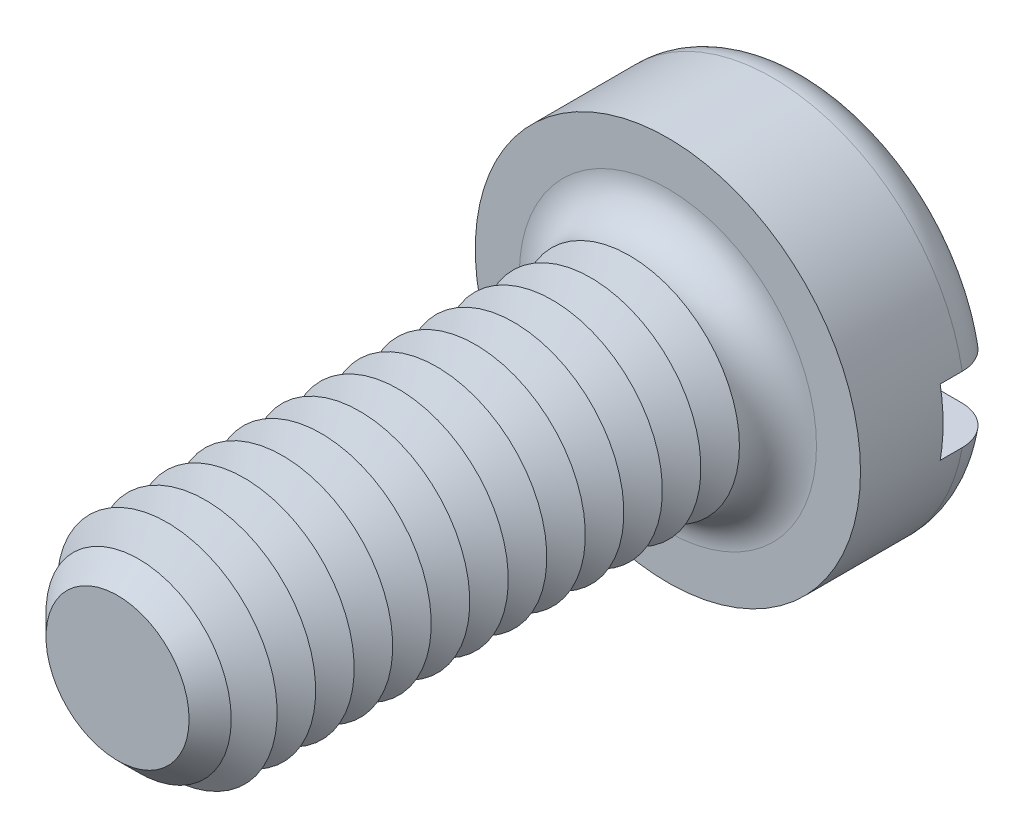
ISO-10303-21;
HEADER;
FILE_DESCRIPTION(('STEP AP214'),'2;1');
FILE_NAME('part.step','',(''),(''),'','','');
FILE_SCHEMA(('AUTOMOTIVE_DESIGN { 1 0 10303 214 1 1 1 1 }'));
ENDSEC;
DATA;
#1=APPLICATION_CONTEXT('core data for automotive mechanical design processes');
#2=APPLICATION_PROTOCOL_DEFINITION('international standard','automotive_design',2000,#1);
#3=PRODUCT_CONTEXT('',#1,'mechanical');
#4=PRODUCT('Part','Part','',(#3));
#5=PRODUCT_RELATED_PRODUCT_CATEGORY('part','',(#4));
#6=PRODUCT_DEFINITION_FORMATION('','',#4);
#7=PRODUCT_DEFINITION_CONTEXT('part definition',#1,'design');
#8=PRODUCT_DEFINITION('design','',#6,#7);
#9=PRODUCT_DEFINITION_SHAPE('','',#8);
#10=(LENGTH_UNIT() NAMED_UNIT(*) SI_UNIT(.MILLI.,.METRE.));
#11=(NAMED_UNIT(*) PLANE_ANGLE_UNIT() SI_UNIT($,.RADIAN.));
#12=(NAMED_UNIT(*) SI_UNIT($,.STERADIAN.) SOLID_ANGLE_UNIT());
#13=UNCERTAINTY_MEASURE_WITH_UNIT(LENGTH_MEASURE(1.E-05),#10,'distance_accuracy_value','');
#14=(GEOMETRIC_REPRESENTATION_CONTEXT(3) GLOBAL_UNCERTAINTY_ASSIGNED_CONTEXT((#13)) GLOBAL_UNIT_ASSIGNED_CONTEXT((#10,
#11,#12)) REPRESENTATION_CONTEXT('',''));
#15=CARTESIAN_POINT('',(0.,0.,0.));
#16=DIRECTION('',(0.,0.,1.));
#17=DIRECTION('',(1.,0.,0.));
#18=AXIS2_PLACEMENT_3D('',#15,#16,#17);
#19=CARTESIAN_POINT('',(0.,0.,-2.6));
#20=DIRECTION('',(0.,0.,1.));
#21=DIRECTION('',(1.,0.,0.));
#22=AXIS2_PLACEMENT_3D('',#19,#20,#21);
#23=PLANE('',#22);
#24=CARTESIAN_POINT('',(0.,0.,-2.6));
#25=DIRECTION('',(0.,0.,1.));
#26=DIRECTION('',(1.,0.,0.));
#27=AXIS2_PLACEMENT_3D('',#24,#25,#26);
#28=CIRCLE('',#27,2.8);
#29=CARTESIAN_POINT('',(-2.73495886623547,0.6,-2.6));
#30=VERTEX_POINT('',#29);
#31=CARTESIAN_POINT('',(2.73495886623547,0.6,-2.6));
#32=VERTEX_POINT('',#31);
#33=EDGE_CURVE('E116',#30,#32,#28,.F.);
#34=ORIENTED_EDGE('',*,*,#33,.T.);
#35=DIRECTION('',(1.,0.,0.));
#36=VECTOR('',#35,1.);
#37=CARTESIAN_POINT('',(-3.5,0.600000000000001,-2.6));
#38=LINE('',#37,#36);
#39=EDGE_CURVE('E111',#30,#32,#38,.T.);
#40=ORIENTED_EDGE('',*,*,#39,.F.);
#41=EDGE_LOOP('',(#34,#40));
#42=FACE_BOUND('',#41,.T.);
#43=ADVANCED_FACE('F39',(#42),#23,.F.);
#44=CARTESIAN_POINT('',(0.,0.,-1.9));
#45=DIRECTION('',(0.,0.,1.));
#46=DIRECTION('',(1.,0.,0.));
#47=AXIS2_PLACEMENT_3D('',#44,#45,#46);
#48=TOROIDAL_SURFACE('',#47,2.8,0.7);
#49=CARTESIAN_POINT('',(-3.24550494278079,0.600000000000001,-2.38938679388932));
#50=CARTESIAN_POINT('',(-3.21724139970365,0.600000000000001,-2.41780774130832));
#51=CARTESIAN_POINT('',(-3.18652103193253,0.600000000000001,-2.44383169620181));
#52=CARTESIAN_POINT('',(-3.12110229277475,0.600000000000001,-2.49034599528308));
#53=CARTESIAN_POINT('',(-3.08639834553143,0.6,-2.51082844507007));
#54=CARTESIAN_POINT('',(-3.01410013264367,0.6,-2.54568075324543));
#55=CARTESIAN_POINT('',(-2.97650963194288,0.6,-2.56005841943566));
#56=CARTESIAN_POINT('',(-2.89948250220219,0.6,-2.58239238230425));
#57=CARTESIAN_POINT('',(-2.86004633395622,0.6,-2.59035027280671));
#58=CARTESIAN_POINT('',(-2.77983715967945,0.6,-2.5997577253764));
#59=CARTESIAN_POINT('',(-2.73905311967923,0.6,-2.60111317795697));
#60=CARTESIAN_POINT('',(-2.65781876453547,0.6,-2.59706866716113));
#61=CARTESIAN_POINT('',(-2.61736849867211,0.6,-2.59166772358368));
#62=CARTESIAN_POINT('',(-2.53729983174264,0.6,-2.57414594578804));
#63=CARTESIAN_POINT('',(-2.49770360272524,0.6,-2.56192363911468));
#64=CARTESIAN_POINT('',(-2.421111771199,0.6,-2.5310238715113));
#65=CARTESIAN_POINT('',(-2.38411632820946,0.6,-2.51234601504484));
#66=CARTESIAN_POINT('',(-2.31371213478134,0.6,-2.46896762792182));
#67=CARTESIAN_POINT('',(-2.28031240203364,0.6,-2.44425244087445));
#68=CARTESIAN_POINT('',(-2.21823311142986,0.6,-2.38946667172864));
#69=CARTESIAN_POINT('',(-2.18955321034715,0.6,-2.35939647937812));
#70=CARTESIAN_POINT('',(-2.13836074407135,0.6,-2.29532787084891));
#71=CARTESIAN_POINT('',(-2.11574147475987,0.6,-2.26141482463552));
#72=CARTESIAN_POINT('',(-2.07677080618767,0.6,-2.19015935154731));
#73=CARTESIAN_POINT('',(-2.06041784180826,0.6,-2.15281778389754));
#74=CARTESIAN_POINT('',(-2.03508596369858,0.6,-2.07723332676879));
#75=CARTESIAN_POINT('',(-2.02585871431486,0.6,-2.03907365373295));
#76=CARTESIAN_POINT('',(-2.01416722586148,0.6,-1.96173417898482));
#77=CARTESIAN_POINT('',(-2.01170151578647,0.6,-1.92255460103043));
#78=CARTESIAN_POINT('',(-2.01359934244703,0.6,-1.84555709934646));
#79=CARTESIAN_POINT('',(-2.01775787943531,0.6,-1.80773393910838));
#80=CARTESIAN_POINT('',(-2.03236373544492,0.6,-1.73332511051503));
#81=CARTESIAN_POINT('',(-2.04281097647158,0.6,-1.69673942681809));
#82=CARTESIAN_POINT('',(-2.06962963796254,0.6,-1.62577336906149));
#83=CARTESIAN_POINT('',(-2.08600685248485,0.6,-1.59139519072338));
#84=CARTESIAN_POINT('',(-2.12413495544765,0.6,-1.52576356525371));
#85=CARTESIAN_POINT('',(-2.14588657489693,0.6,-1.49451054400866));
#86=CARTESIAN_POINT('',(-2.19483541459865,0.6,-1.43498643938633));
#87=CARTESIAN_POINT('',(-2.22217844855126,0.6,-1.40683532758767));
#88=CARTESIAN_POINT('',(-2.28105616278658,0.6,-1.35532544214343));
#89=CARTESIAN_POINT('',(-2.3125916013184,0.6,-1.33196753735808));
#90=CARTESIAN_POINT('',(-2.38018779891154,0.6,-1.28984356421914));
#91=CARTESIAN_POINT('',(-2.41637068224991,0.6,-1.27127330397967));
#92=CARTESIAN_POINT('',(-2.49129688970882,0.6,-1.24032971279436));
#93=CARTESIAN_POINT('',(-2.53004053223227,0.6,-1.22795715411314));
#94=CARTESIAN_POINT('',(-2.6098393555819,0.6,-1.2095515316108));
#95=CARTESIAN_POINT('',(-2.65092550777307,0.6,-1.20365237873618));
#96=CARTESIAN_POINT('',(-2.7335069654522,0.6,-1.1988380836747));
#97=CARTESIAN_POINT('',(-2.7750022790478,0.6,-1.19992308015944));
#98=CARTESIAN_POINT('',(-2.85718851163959,0.6,-1.20909046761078));
#99=CARTESIAN_POINT('',(-2.8978799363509,0.6,-1.21716830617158));
#100=CARTESIAN_POINT('',(-2.97729176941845,0.6,-1.24014327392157));
#101=CARTESIAN_POINT('',(-3.01601231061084,0.6,-1.25503994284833));
#102=CARTESIAN_POINT('',(-3.08976822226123,0.6,-1.29101066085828));
#103=CARTESIAN_POINT('',(-3.12484927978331,0.600000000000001,-1.31199098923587));
#104=CARTESIAN_POINT('',(-3.19090022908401,0.600000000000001,-1.35965144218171));
#105=CARTESIAN_POINT('',(-3.22187053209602,0.600000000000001,-1.38633099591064));
#106=CARTESIAN_POINT('',(-3.2781946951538,0.600000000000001,-1.44408564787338));
#107=CARTESIAN_POINT('',(-3.3036441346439,0.600000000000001,-1.47506754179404));
#108=CARTESIAN_POINT('',(-3.34887649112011,0.600000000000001,-1.54092398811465));
#109=CARTESIAN_POINT('',(-3.36865993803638,0.600000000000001,-1.57579817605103));
#110=CARTESIAN_POINT('',(-3.40166738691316,0.600000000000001,-1.64783067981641));
#111=CARTESIAN_POINT('',(-3.41499360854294,0.600000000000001,-1.68494217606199));
#112=CARTESIAN_POINT('',(-3.43515375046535,0.600000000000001,-1.76088675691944));
#113=CARTESIAN_POINT('',(-3.44198836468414,0.600000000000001,-1.79971965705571));
#114=CARTESIAN_POINT('',(-3.44891916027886,0.600000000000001,-1.87757893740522));
#115=CARTESIAN_POINT('',(-3.44908375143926,0.600000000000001,-1.91659924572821));
#116=CARTESIAN_POINT('',(-3.44284111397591,0.600000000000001,-1.99412088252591));
#117=CARTESIAN_POINT('',(-3.43643236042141,0.600000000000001,-2.03262208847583));
#118=CARTESIAN_POINT('',(-3.41725803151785,0.600000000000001,-2.10792315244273));
#119=CARTESIAN_POINT('',(-3.40450469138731,0.600000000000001,-2.14472613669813));
#120=CARTESIAN_POINT('',(-3.3730385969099,0.600000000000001,-2.21565060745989));
#121=CARTESIAN_POINT('',(-3.35433321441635,0.600000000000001,-2.24977534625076));
#122=CARTESIAN_POINT('',(-3.3201892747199,0.600000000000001,-2.30136364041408));
#123=CARTESIAN_POINT('',(-3.30647805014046,0.600000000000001,-2.31999402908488));
#124=CARTESIAN_POINT('',(-3.27728518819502,0.600000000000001,-2.35581090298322));
#125=CARTESIAN_POINT('',(-3.26180356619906,0.600000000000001,-2.37299740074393));
#126=CARTESIAN_POINT('',(-3.24550494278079,0.600000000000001,-2.38938679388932));
#127=B_SPLINE_CURVE_WITH_KNOTS('',3,(#49,#50,#51,#52,#53,#54,#55,#56,#57,#58,#59,#60,#61,#62,
#63,#64,#65,#66,#67,#68,#69,#70,#71,#72,#73,#74,#75,#76,#77,#78,#79,#80,#81,#82,#83,#84,#85,#86,
#87,#88,#89,#90,#91,#92,#93,#94,#95,#96,#97,#98,#99,#100,#101,#102,#103,#104,#105,#106,#107,
#108,#109,#110,#111,#112,#113,#114,#115,#116,#117,#118,#119,#120,#121,#122,#123,#124,#125,#126),
.UNSPECIFIED.,.T.,.F.,(4,2,2,2,2,2,2,2,2,2,2,2,2,2,2,2,2,2,2,2,2,2,2,2,2,2,2,2,2,2,2,2,2,2,2,2,
2,2,4),(0.,0.120160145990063,0.240490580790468,0.36066665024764,0.480812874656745,
0.602666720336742,0.724538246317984,0.848272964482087,0.972015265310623,1.09606100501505,
1.2200977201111,1.34178071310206,1.46343329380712,1.58062647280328,1.6977941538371,
1.81140573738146,1.92501591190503,2.03873739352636,2.15247435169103,2.26967910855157,
2.38690509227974,2.50835551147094,2.62982106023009,2.75375450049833,2.87769040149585,
3.00154567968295,3.12539259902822,3.24742469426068,3.36944457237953,3.48914477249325,
3.60883377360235,3.72656056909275,3.84427477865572,3.96078136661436,4.07731498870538,
4.19362474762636,4.3097910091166,4.37908387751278,4.44837614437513),.UNSPECIFIED.);
#128=CARTESIAN_POINT('',(-3.44818792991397,0.600000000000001,-1.8999999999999));
#129=VERTEX_POINT('',#128);
#130=EDGE_CURVE('E289',#129,#30,#127,.T.);
#131=ORIENTED_EDGE('',*,*,#130,.F.);
#132=CARTESIAN_POINT('',(0.,0.,-1.9));
#133=DIRECTION('',(0.,0.,1.));
#134=DIRECTION('',(1.,0.,0.));
#135=AXIS2_PLACEMENT_3D('',#132,#133,#134);
#136=CIRCLE('',#135,3.5);
#137=CARTESIAN_POINT('',(3.44818792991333,0.6,-1.9));
#138=VERTEX_POINT('',#137);
#139=EDGE_CURVE('E125',#138,#129,#136,.T.);
#140=ORIENTED_EDGE('',*,*,#139,.F.);
#141=CARTESIAN_POINT('',(2.1414268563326,0.6,-2.29762171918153));
#142=CARTESIAN_POINT('',(2.16505443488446,0.6,-2.33058245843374));
#143=CARTESIAN_POINT('',(2.19155609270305,0.6,-2.36152717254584));
#144=CARTESIAN_POINT('',(2.24942944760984,0.6,-2.41852964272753));
#145=CARTESIAN_POINT('',(2.28080921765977,0.6,-2.44457913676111));
#146=CARTESIAN_POINT('',(2.34741203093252,0.6,-2.49105381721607));
#147=CARTESIAN_POINT('',(2.38262862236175,0.6,-2.51148824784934));
#148=CARTESIAN_POINT('',(2.45593176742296,0.6,-2.54626881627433));
#149=CARTESIAN_POINT('',(2.49401741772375,0.6,-2.56061686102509));
#150=CARTESIAN_POINT('',(2.57272605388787,0.6,-2.58306429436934));
#151=CARTESIAN_POINT('',(2.6133821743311,0.6,-2.59104769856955));
#152=CARTESIAN_POINT('',(2.6954618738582,0.6,-2.60009608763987));
#153=CARTESIAN_POINT('',(2.73688552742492,0.6,-2.60116039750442));
#154=CARTESIAN_POINT('',(2.81941950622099,0.6,-2.5962925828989));
#155=CARTESIAN_POINT('',(2.86052888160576,0.6,-2.59034422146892));
#156=CARTESIAN_POINT('',(2.94113709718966,0.6,-2.57153687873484));
#157=CARTESIAN_POINT('',(2.98063603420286,0.6,-2.55867831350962));
#158=CARTESIAN_POINT('',(3.05633735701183,0.6,-2.52657771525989));
#159=CARTESIAN_POINT('',(3.09257627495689,0.6,-2.50742188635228));
#160=CARTESIAN_POINT('',(3.16123898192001,0.6,-2.46318606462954));
#161=CARTESIAN_POINT('',(3.19366316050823,0.6,-2.4381066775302));
#162=CARTESIAN_POINT('',(3.25312278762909,0.6,-2.38324481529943));
#163=CARTESIAN_POINT('',(3.28024842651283,0.6,-2.35356008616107));
#164=CARTESIAN_POINT('',(3.32902587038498,0.6,-2.28998971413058));
#165=CARTESIAN_POINT('',(3.35067820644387,0.6,-2.25610447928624));
#166=CARTESIAN_POINT('',(3.38751207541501,0.6,-2.18572286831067));
#167=CARTESIAN_POINT('',(3.40279804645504,0.6,-2.14928112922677));
#168=CARTESIAN_POINT('',(3.42695590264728,0.6,-2.07433042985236));
#169=CARTESIAN_POINT('',(3.43582824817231,0.6,-2.03582161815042));
#170=CARTESIAN_POINT('',(3.44682113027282,0.6,-1.95829536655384));
#171=CARTESIAN_POINT('',(3.44901648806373,0.6,-1.91928851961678));
#172=CARTESIAN_POINT('',(3.44680085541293,0.6,-1.84146366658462));
#173=CARTESIAN_POINT('',(3.44239008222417,0.6,-1.80264565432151));
#174=CARTESIAN_POINT('',(3.42712544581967,0.6,-1.72644634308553));
#175=CARTESIAN_POINT('',(3.41629508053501,0.6,-1.6890603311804));
#176=CARTESIAN_POINT('',(3.38853757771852,0.6,-1.61662604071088));
#177=CARTESIAN_POINT('',(3.37161039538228,0.6,-1.58157777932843));
#178=CARTESIAN_POINT('',(3.33207798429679,0.6,-1.51464178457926));
#179=CARTESIAN_POINT('',(3.30944854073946,0.6,-1.48276835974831));
#180=CARTESIAN_POINT('',(3.2592165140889,0.6,-1.42321861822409));
#181=CARTESIAN_POINT('',(3.23161370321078,0.6,-1.3955424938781));
#182=CARTESIAN_POINT('',(3.17188519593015,0.6,-1.34481834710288));
#183=CARTESIAN_POINT('',(3.13971065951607,0.6,-1.32182785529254));
#184=CARTESIAN_POINT('',(3.07201123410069,0.6,-1.28147003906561));
#185=CARTESIAN_POINT('',(3.03648608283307,0.6,-1.26410315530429));
#186=CARTESIAN_POINT('',(2.962449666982,0.6,-1.2351645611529));
#187=CARTESIAN_POINT('',(2.92389781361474,0.6,-1.22369671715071));
#188=CARTESIAN_POINT('',(2.84543273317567,0.6,-1.20726565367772));
#189=CARTESIAN_POINT('',(2.80551936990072,0.6,-1.20230308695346));
#190=CARTESIAN_POINT('',(2.72467191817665,0.6,-1.1989357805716));
#191=CARTESIAN_POINT('',(2.68373266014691,0.6,-1.20065484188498));
#192=CARTESIAN_POINT('',(2.60270222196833,0.6,-1.21084560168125));
#193=CARTESIAN_POINT('',(2.56261112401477,0.6,-1.21931795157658));
#194=CARTESIAN_POINT('',(2.48385954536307,0.6,-1.24292934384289));
#195=CARTESIAN_POINT('',(2.44522508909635,0.6,-1.25815531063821));
#196=CARTESIAN_POINT('',(2.37106165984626,0.6,-1.29488663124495));
#197=CARTESIAN_POINT('',(2.33553282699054,0.6,-1.31639226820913));
#198=CARTESIAN_POINT('',(2.2686996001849,0.6,-1.36507949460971));
#199=CARTESIAN_POINT('',(2.23738745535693,0.6,-1.39225042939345));
#200=CARTESIAN_POINT('',(2.17990424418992,0.6,-1.45157941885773));
#201=CARTESIAN_POINT('',(2.15373259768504,0.6,-1.48373691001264));
#202=CARTESIAN_POINT('',(2.10799355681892,0.6,-1.551327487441));
#203=CARTESIAN_POINT('',(2.08828258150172,0.6,-1.58666329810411));
#204=CARTESIAN_POINT('',(2.05534440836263,0.6,-1.66023600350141));
#205=CARTESIAN_POINT('',(2.042115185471,0.6,-1.6984719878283));
#206=CARTESIAN_POINT('',(2.02303126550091,0.6,-1.77519783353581));
#207=CARTESIAN_POINT('',(2.01691541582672,0.6,-1.8136228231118));
#208=CARTESIAN_POINT('',(2.01140375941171,0.6,-1.89096056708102));
#209=CARTESIAN_POINT('',(2.01200856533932,0.6,-1.92987336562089));
#210=CARTESIAN_POINT('',(2.01981617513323,0.6,-2.006065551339));
#211=CARTESIAN_POINT('',(2.02685835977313,0.6,-2.04336165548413));
#212=CARTESIAN_POINT('',(2.0470502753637,0.6,-2.1162250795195));
#213=CARTESIAN_POINT('',(2.06019252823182,0.6,-2.15179445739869));
#214=CARTESIAN_POINT('',(2.08525738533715,0.6,-2.20558874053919));
#215=CARTESIAN_POINT('',(2.09529161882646,0.6,-2.22471751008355));
#216=CARTESIAN_POINT('',(2.11708813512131,0.6,-2.26196179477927));
#217=CARTESIAN_POINT('',(2.12885034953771,0.6,-2.28007734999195));
#218=CARTESIAN_POINT('',(2.1414268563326,0.6,-2.29762171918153));
#219=B_SPLINE_CURVE_WITH_KNOTS('',3,(#141,#142,#143,#144,#145,#146,#147,#148,#149,#150,#151,
#152,#153,#154,#155,#156,#157,#158,#159,#160,#161,#162,#163,#164,#165,#166,#167,#168,#169,#170,
#171,#172,#173,#174,#175,#176,#177,#178,#179,#180,#181,#182,#183,#184,#185,#186,#187,#188,#189,
#190,#191,#192,#193,#194,#195,#196,#197,#198,#199,#200,#201,#202,#203,#204,#205,#206,#207,#208,
#209,#210,#211,#212,#213,#214,#215,#216,#217,#218),.UNSPECIFIED.,.T.,.F.,(4,2,2,2,2,2,2,2,2,2,2,
2,2,2,2,2,2,2,2,2,2,2,2,2,2,2,2,2,2,2,2,2,2,2,2,2,2,2,4),(0.,0.121582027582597,
0.243367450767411,0.364951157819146,0.486496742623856,0.610209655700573,0.733934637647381,
0.857946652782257,0.981951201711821,1.1043243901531,1.22668507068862,1.34673532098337,
1.46677391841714,1.58475736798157,1.70273234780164,1.81938035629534,1.93602452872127,
2.05224435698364,2.168465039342,2.28518782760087,2.40191596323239,2.52000081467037,
2.63809491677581,2.75820270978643,2.87832255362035,3.00067856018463,3.1230463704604,
3.24703703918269,3.37103329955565,3.49479843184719,3.6185495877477,3.73932715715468,
3.86006696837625,3.9762182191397,4.09238005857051,4.2057203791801,4.31892212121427,
4.38364046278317,4.44835624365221),.UNSPECIFIED.);
#220=EDGE_CURVE('E291',#32,#138,#219,.T.);
#221=ORIENTED_EDGE('',*,*,#220,.F.);
#222=ORIENTED_EDGE('',*,*,#33,.F.);
#223=EDGE_LOOP('',(#131,#140,#221,#222));
#224=FACE_BOUND('',#223,.T.);
#225=ADVANCED_FACE('F273',(#224),#48,.T.);
#226=CARTESIAN_POINT('',(0.,0.,-2.6));
#227=DIRECTION('',(0.,0.,1.));
#228=DIRECTION('',(1.,0.,0.));
#229=AXIS2_PLACEMENT_3D('',#226,#227,#228);
#230=CYLINDRICAL_SURFACE('',#229,3.5);
#231=DIRECTION('',(0.,0.,1.));
#232=VECTOR('',#231,1.);
#233=CARTESIAN_POINT('',(3.44818792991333,0.6,-2.6));
#234=LINE('',#233,#232);
#235=CARTESIAN_POINT('',(3.44818792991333,0.6,-1.5));
#236=VERTEX_POINT('',#235);
#237=EDGE_CURVE('E307',#138,#236,#234,.T.);
#238=ORIENTED_EDGE('',*,*,#237,.F.);
#239=ORIENTED_EDGE('',*,*,#139,.T.);
#240=DIRECTION('',(0.,0.,1.));
#241=VECTOR('',#240,1.);
#242=CARTESIAN_POINT('',(-3.44818792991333,0.600000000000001,-2.6));
#243=LINE('',#242,#241);
#244=CARTESIAN_POINT('',(-3.44818792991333,0.600000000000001,-1.5));
#245=VERTEX_POINT('',#244);
#246=EDGE_CURVE('E63',#245,#129,#243,.F.);
#247=ORIENTED_EDGE('',*,*,#246,.F.);
#248=CARTESIAN_POINT('',(0.,0.,-1.5));
#249=DIRECTION('',(0.,0.,-1.));
#250=DIRECTION('',(-1.,0.,0.));
#251=AXIS2_PLACEMENT_3D('',#248,#249,#250);
#252=CIRCLE('',#251,3.5);
#253=CARTESIAN_POINT('',(-3.44818792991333,-0.599999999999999,-1.5));
#254=VERTEX_POINT('',#253);
#255=EDGE_CURVE('E43',#245,#254,#252,.F.);
#256=ORIENTED_EDGE('',*,*,#255,.T.);
#257=DIRECTION('',(0.,0.,1.));
#258=VECTOR('',#257,1.);
#259=CARTESIAN_POINT('',(-3.44818792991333,-0.599999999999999,-2.6));
#260=LINE('',#259,#258);
#261=CARTESIAN_POINT('',(-3.44818792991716,-0.599999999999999,-1.90000000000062));
#262=VERTEX_POINT('',#261);
#263=EDGE_CURVE('E304',#262,#254,#260,.T.);
#264=ORIENTED_EDGE('',*,*,#263,.F.);
#265=CARTESIAN_POINT('',(3.44818792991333,-0.6,-1.9));
#266=VERTEX_POINT('',#265);
#267=EDGE_CURVE('E127',#262,#266,#136,.T.);
#268=ORIENTED_EDGE('',*,*,#267,.T.);
#269=DIRECTION('',(0.,0.,1.));
#270=VECTOR('',#269,1.);
#271=CARTESIAN_POINT('',(3.44818792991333,-0.6,-2.6));
#272=LINE('',#271,#270);
#273=CARTESIAN_POINT('',(3.44818792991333,-0.6,-1.5));
#274=VERTEX_POINT('',#273);
#275=EDGE_CURVE('E55',#274,#266,#272,.F.);
#276=ORIENTED_EDGE('',*,*,#275,.F.);
#277=EDGE_CURVE('E11',#274,#236,#252,.F.);
#278=ORIENTED_EDGE('',*,*,#277,.T.);
#279=EDGE_LOOP('',(#238,#239,#247,#256,#264,#268,#276,#278));
#280=FACE_BOUND('',#279,.T.);
#281=CARTESIAN_POINT('',(0.,0.,0.));
#282=DIRECTION('',(0.,0.,1.));
#283=DIRECTION('',(1.,0.,0.));
#284=AXIS2_PLACEMENT_3D('',#281,#282,#283);
#285=CIRCLE('',#284,3.5);
#286=CARTESIAN_POINT('',(3.5,0.,0.));
#287=VERTEX_POINT('',#286);
#288=EDGE_CURVE('E310',#287,#287,#285,.T.);
#289=ORIENTED_EDGE('',*,*,#288,.F.);
#290=EDGE_LOOP('',(#289));
#291=FACE_BOUND('',#290,.T.);
#292=ADVANCED_FACE('F269',(#280,#291),#230,.T.);
#293=CARTESIAN_POINT('',(2.73495886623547,-0.6,-2.6));
#294=VERTEX_POINT('',#293);
#295=CARTESIAN_POINT('',(-2.73495886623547,-0.6,-2.6));
#296=VERTEX_POINT('',#295);
#297=EDGE_CURVE('E109',#294,#296,#28,.F.);
#298=ORIENTED_EDGE('',*,*,#297,.T.);
#299=DIRECTION('',(-1.,0.,0.));
#300=VECTOR('',#299,1.);
#301=CARTESIAN_POINT('',(-3.5,-0.599999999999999,-2.6));
#302=LINE('',#301,#300);
#303=EDGE_CURVE('E96',#294,#296,#302,.T.);
#304=ORIENTED_EDGE('',*,*,#303,.F.);
#305=EDGE_LOOP('',(#298,#304));
#306=FACE_BOUND('',#305,.T.);
#307=ADVANCED_FACE('F108',(#306),#23,.F.);
#308=CARTESIAN_POINT('',(0.,0.,0.));
#309=DIRECTION('',(0.,0.,1.));
#310=DIRECTION('',(1.,0.,0.));
#311=AXIS2_PLACEMENT_3D('',#308,#309,#310);
#312=PLANE('',#311);
#313=CARTESIAN_POINT('',(0.,0.,0.));
#314=DIRECTION('',(0.,0.,1.));
#315=DIRECTION('',(1.,0.,0.));
#316=AXIS2_PLACEMENT_3D('',#313,#314,#315);
#317=CIRCLE('',#316,2.7);
#318=CARTESIAN_POINT('',(2.7,0.,0.));
#319=VERTEX_POINT('',#318);
#320=EDGE_CURVE('E115',#319,#319,#317,.F.);
#321=ORIENTED_EDGE('',*,*,#320,.T.);
#322=EDGE_LOOP('',(#321));
#323=FACE_BOUND('',#322,.T.);
#324=ORIENTED_EDGE('',*,*,#288,.T.);
#325=EDGE_LOOP('',(#324));
#326=FACE_BOUND('',#325,.T.);
#327=ADVANCED_FACE('F268',(#323,#326),#312,.T.);
#328=CARTESIAN_POINT('',(-3.24550494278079,-0.599999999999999,-2.38938679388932));
#329=CARTESIAN_POINT('',(-3.27309693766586,-0.599999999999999,-2.36163611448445));
#330=CARTESIAN_POINT('',(-3.29838741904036,-0.599999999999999,-2.3315608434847));
#331=CARTESIAN_POINT('',(-3.34359429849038,-0.599999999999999,-2.26757659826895));
#332=CARTESIAN_POINT('',(-3.36350518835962,-0.599999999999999,-2.23366374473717));
#333=CARTESIAN_POINT('',(-3.39733065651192,-0.599999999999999,-2.16296274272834));
#334=CARTESIAN_POINT('',(-3.4112451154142,-0.599999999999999,-2.12617453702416));
#335=CARTESIAN_POINT('',(-3.43264462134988,-0.599999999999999,-2.05078178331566));
#336=CARTESIAN_POINT('',(-3.44013114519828,-0.599999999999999,-2.01217765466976));
#337=CARTESIAN_POINT('',(-3.44841975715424,-0.599999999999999,-1.9345391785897));
#338=CARTESIAN_POINT('',(-3.44926944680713,-0.599999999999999,-1.89550990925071));
#339=CARTESIAN_POINT('',(-3.44438358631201,-0.599999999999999,-1.81786552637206));
#340=CARTESIAN_POINT('',(-3.43864801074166,-0.599999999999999,-1.77925041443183));
#341=CARTESIAN_POINT('',(-3.42079221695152,-0.599999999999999,-1.70364264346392));
#342=CARTESIAN_POINT('',(-3.40869011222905,-0.599999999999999,-1.66664570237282));
#343=CARTESIAN_POINT('',(-3.37847692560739,-0.599999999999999,-1.59519424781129));
#344=CARTESIAN_POINT('',(-3.3603657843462,-0.599999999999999,-1.56073975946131));
#345=CARTESIAN_POINT('',(-3.31856549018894,-0.599999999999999,-1.4951524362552));
#346=CARTESIAN_POINT('',(-3.29484830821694,-0.599999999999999,-1.46403747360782));
#347=CARTESIAN_POINT('',(-3.24258489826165,-0.599999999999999,-1.40617131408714));
#348=CARTESIAN_POINT('',(-3.21403843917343,-0.599999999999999,-1.37942032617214));
#349=CARTESIAN_POINT('',(-3.15256084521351,-0.599999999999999,-1.33067963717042));
#350=CARTESIAN_POINT('',(-3.11958015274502,-0.599999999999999,-1.30875246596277));
#351=CARTESIAN_POINT('',(-3.0504559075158,-0.599999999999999,-1.27063718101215));
#352=CARTESIAN_POINT('',(-3.01431209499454,-0.6,-1.25444953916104));
#353=CARTESIAN_POINT('',(-2.93921710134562,-0.6,-1.22796796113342));
#354=CARTESIAN_POINT('',(-2.90022796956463,-0.6,-1.217781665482));
#355=CARTESIAN_POINT('',(-2.82110512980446,-0.6,-1.20396915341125));
#356=CARTESIAN_POINT('',(-2.7809713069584,-0.6,-1.2003435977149));
#357=CARTESIAN_POINT('',(-2.69990924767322,-0.6,-1.19969717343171));
#358=CARTESIAN_POINT('',(-2.65898001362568,-0.6,-1.20279937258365));
#359=CARTESIAN_POINT('',(-2.57819986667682,-0.6,-1.21574287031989));
#360=CARTESIAN_POINT('',(-2.53834905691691,-0.6,-1.22558481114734));
#361=CARTESIAN_POINT('',(-2.46035232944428,-0.6,-1.25189361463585));
#362=CARTESIAN_POINT('',(-2.42223314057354,-0.6,-1.2684398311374));
#363=CARTESIAN_POINT('',(-2.34932316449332,-0.6,-1.30771928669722));
#364=CARTESIAN_POINT('',(-2.31453248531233,-0.6,-1.33045272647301));
#365=CARTESIAN_POINT('',(-2.24945577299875,-0.6,-1.38141543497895));
#366=CARTESIAN_POINT('',(-2.21915255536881,-0.6,-1.40962272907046));
#367=CARTESIAN_POINT('',(-2.16386461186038,-0.6,-1.47084552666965));
#368=CARTESIAN_POINT('',(-2.13887916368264,-0.6,-1.50386037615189));
#369=CARTESIAN_POINT('',(-2.09568071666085,-0.6,-1.57285917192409));
#370=CARTESIAN_POINT('',(-2.07730739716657,-0.6,-1.60874263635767));
#371=CARTESIAN_POINT('',(-2.04712019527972,-0.6,-1.68316975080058));
#372=CARTESIAN_POINT('',(-2.03530452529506,-0.6,-1.72171267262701));
#373=CARTESIAN_POINT('',(-2.01901751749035,-0.6,-1.79878952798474));
#374=CARTESIAN_POINT('',(-2.01428434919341,-0.6,-1.8372682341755));
#375=CARTESIAN_POINT('',(-2.01150652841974,-0.6,-1.91446369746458));
#376=CARTESIAN_POINT('',(-2.01346084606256,-0.6,-1.95318041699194));
#377=CARTESIAN_POINT('',(-2.02386268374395,-0.6,-2.0288619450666));
#378=CARTESIAN_POINT('',(-2.03216724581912,-0.6,-2.06584654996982));
#379=CARTESIAN_POINT('',(-2.05479337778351,-0.6,-2.13792373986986));
#380=CARTESIAN_POINT('',(-2.06911522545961,-0.6,-2.1730162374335));
#381=CARTESIAN_POINT('',(-2.10349906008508,-0.6,-2.24081034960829));
#382=CARTESIAN_POINT('',(-2.12363007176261,-0.6,-2.27347689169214));
#383=CARTESIAN_POINT('',(-2.16891308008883,-0.6,-2.33511902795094));
#384=CARTESIAN_POINT('',(-2.19406590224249,-0.6,-2.36409401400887));
#385=CARTESIAN_POINT('',(-2.24962389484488,-0.6,-2.41861972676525));
#386=CARTESIAN_POINT('',(-2.28018314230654,-0.6,-2.44401345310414));
#387=CARTESIAN_POINT('',(-2.34501720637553,-0.6,-2.48950558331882));
#388=CARTESIAN_POINT('',(-2.37929266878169,-0.6,-2.50960306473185));
#389=CARTESIAN_POINT('',(-2.45179417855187,-0.6,-2.54458276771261));
#390=CARTESIAN_POINT('',(-2.49011248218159,-0.6,-2.55927401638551));
#391=CARTESIAN_POINT('',(-2.56865227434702,-0.6,-2.58211133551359));
#392=CARTESIAN_POINT('',(-2.60887386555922,-0.6,-2.59025705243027));
#393=CARTESIAN_POINT('',(-2.69064746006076,-0.6,-2.59982905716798));
#394=CARTESIAN_POINT('',(-2.73220999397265,-0.6,-2.60116580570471));
#395=CARTESIAN_POINT('',(-2.81497658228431,-0.6,-2.59679700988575));
#396=CARTESIAN_POINT('',(-2.85618055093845,-0.6,-2.59108982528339));
#397=CARTESIAN_POINT('',(-2.93677683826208,-0.6,-2.57279487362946));
#398=CARTESIAN_POINT('',(-2.97617834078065,-0.6,-2.56024753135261));
#399=CARTESIAN_POINT('',(-3.05222242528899,-0.6,-2.52860709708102));
#400=CARTESIAN_POINT('',(-3.08886850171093,-0.599999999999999,-2.50952247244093));
#401=CARTESIAN_POINT('',(-3.14562501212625,-0.599999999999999,-2.47340693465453));
#402=CARTESIAN_POINT('',(-3.16689358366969,-0.599999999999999,-2.45816337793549));
#403=CARTESIAN_POINT('',(-3.20761866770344,-0.599999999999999,-2.42542115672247));
#404=CARTESIAN_POINT('',(-3.22707520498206,-0.599999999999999,-2.40792252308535));
#405=CARTESIAN_POINT('',(-3.24550494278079,-0.599999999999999,-2.38938679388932));
#406=B_SPLINE_CURVE_WITH_KNOTS('',3,(#328,#329,#330,#331,#332,#333,#334,#335,#336,#337,#338,
#339,#340,#341,#342,#343,#344,#345,#346,#347,#348,#349,#350,#351,#352,#353,#354,#355,#356,#357,
#358,#359,#360,#361,#362,#363,#364,#365,#366,#367,#368,#369,#370,#371,#372,#373,#374,#375,#376,
#377,#378,#379,#380,#381,#382,#383,#384,#385,#386,#387,#388,#389,#390,#391,#392,#393,#394,#395,
#396,#397,#398,#399,#400,#401,#402,#403,#404,#405),.UNSPECIFIED.,.T.,.F.,(4,2,2,2,2,2,2,2,2,2,2,
2,2,2,2,2,2,2,2,2,2,2,2,2,2,2,2,2,2,2,2,2,2,2,2,2,2,2,4),(0.,0.117306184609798,
0.234732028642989,0.352160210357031,0.469561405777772,0.586119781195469,0.702678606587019,
0.818907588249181,0.935137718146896,1.05196174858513,1.1687913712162,1.2870562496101,
1.40533084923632,1.52566688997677,1.64601504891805,1.76858322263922,1.89116307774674,
2.01523830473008,2.13931755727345,2.26290863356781,2.38648291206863,2.50681878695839,
2.62712184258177,2.74285697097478,2.85857427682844,2.97176054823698,3.08495204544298,
3.19954814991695,3.31416310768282,3.43282436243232,3.55150627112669,3.67404987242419,
3.79660009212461,3.92075778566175,4.04494439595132,4.16840490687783,4.29170610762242,
4.3700604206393,4.44841366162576),.UNSPECIFIED.);
#407=EDGE_CURVE('E103',#296,#262,#406,.T.);
#408=ORIENTED_EDGE('',*,*,#407,.F.);
#409=ORIENTED_EDGE('',*,*,#297,.F.);
#410=CARTESIAN_POINT('',(2.1414268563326,-0.6,-2.29762171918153));
#411=CARTESIAN_POINT('',(2.11900044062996,-0.6,-2.26633119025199));
#412=CARTESIAN_POINT('',(2.09913154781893,-0.6,-2.23318080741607));
#413=CARTESIAN_POINT('',(2.06517900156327,-0.6,-2.16401111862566));
#414=CARTESIAN_POINT('',(2.05109968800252,-0.6,-2.12798968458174));
#415=CARTESIAN_POINT('',(2.02923593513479,-0.6,-2.05404277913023));
#416=CARTESIAN_POINT('',(2.02145692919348,-0.6,-2.01611569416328));
#417=CARTESIAN_POINT('',(2.01251710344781,-0.6,-1.93949649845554));
#418=CARTESIAN_POINT('',(2.01135461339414,-0.6,-1.90080458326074));
#419=CARTESIAN_POINT('',(2.01564803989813,-0.6,-1.82450508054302));
#420=CARTESIAN_POINT('',(2.02098305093,-0.6,-1.78689061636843));
#421=CARTESIAN_POINT('',(2.03786826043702,-0.6,-1.71308589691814));
#422=CARTESIAN_POINT('',(2.04941870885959,-0.6,-1.67689569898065));
#423=CARTESIAN_POINT('',(2.07838664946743,-0.6,-1.60676639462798));
#424=CARTESIAN_POINT('',(2.09582944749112,-0.6,-1.57283776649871));
#425=CARTESIAN_POINT('',(2.1359925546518,-0.6,-1.50826612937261));
#426=CARTESIAN_POINT('',(2.15871360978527,-0.6,-1.47762358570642));
#427=CARTESIAN_POINT('',(2.20955413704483,-0.6,-1.41943384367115));
#428=CARTESIAN_POINT('',(2.23782364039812,-0.6,-1.39201777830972));
#429=CARTESIAN_POINT('',(2.29842612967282,-0.6,-1.34212199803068));
#430=CARTESIAN_POINT('',(2.33075984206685,-0.6,-1.31964316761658));
#431=CARTESIAN_POINT('',(2.399806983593,-0.6,-1.27945238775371));
#432=CARTESIAN_POINT('',(2.43663466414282,-0.6,-1.26193653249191));
#433=CARTESIAN_POINT('',(2.51267241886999,-0.6,-1.23320660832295));
#434=CARTESIAN_POINT('',(2.55188277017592,-0.6,-1.22199327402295));
#435=CARTESIAN_POINT('',(2.63235000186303,-0.6,-1.20602688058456));
#436=CARTESIAN_POINT('',(2.673631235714,-0.6,-1.20139617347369));
#437=CARTESIAN_POINT('',(2.7563863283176,-0.6,-1.19914622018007));
#438=CARTESIAN_POINT('',(2.79786018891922,-0.6,-1.20152704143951));
#439=CARTESIAN_POINT('',(2.87971192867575,-0.6,-1.21326884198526));
#440=CARTESIAN_POINT('',(2.92009214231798,-0.6,-1.22261349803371));
#441=CARTESIAN_POINT('',(2.99866777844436,-0.6,-1.24805614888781));
#442=CARTESIAN_POINT('',(3.03686335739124,-0.6,-1.26415365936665));
#443=CARTESIAN_POINT('',(3.10934738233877,-0.6,-1.3023912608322));
#444=CARTESIAN_POINT('',(3.14368704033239,-0.6,-1.32443423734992));
#445=CARTESIAN_POINT('',(3.20808395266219,-0.6,-1.37407725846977));
#446=CARTESIAN_POINT('',(3.23814164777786,-0.6,-1.40167673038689));
#447=CARTESIAN_POINT('',(3.29251534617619,-0.6,-1.46108303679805));
#448=CARTESIAN_POINT('',(3.3169296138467,-0.6,-1.49279994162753));
#449=CARTESIAN_POINT('',(3.35998418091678,-0.6,-1.55993706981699));
#450=CARTESIAN_POINT('',(3.37862502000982,-0.6,-1.59535694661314));
#451=CARTESIAN_POINT('',(3.40930212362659,-0.6,-1.668283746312));
#452=CARTESIAN_POINT('',(3.42143897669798,-0.6,-1.70574837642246));
#453=CARTESIAN_POINT('',(3.43918305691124,-0.6,-1.78219297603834));
#454=CARTESIAN_POINT('',(3.44479069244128,-0.6,-1.82117285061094));
#455=CARTESIAN_POINT('',(3.44928173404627,-0.6,-1.89914596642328));
#456=CARTESIAN_POINT('',(3.44822835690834,-0.6,-1.93813558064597));
#457=CARTESIAN_POINT('',(3.43957811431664,-0.6,-2.0153811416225));
#458=CARTESIAN_POINT('',(3.43198139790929,-0.6,-2.05363710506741));
#459=CARTESIAN_POINT('',(3.41049386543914,-0.6,-2.12826741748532));
#460=CARTESIAN_POINT('',(3.39661362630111,-0.6,-2.16464481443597));
#461=CARTESIAN_POINT('',(3.36297924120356,-0.6,-2.23457274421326));
#462=CARTESIAN_POINT('',(3.34322499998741,-0.6,-2.26812323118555));
#463=CARTESIAN_POINT('',(3.29828706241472,-0.6,-2.33167864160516));
#464=CARTESIAN_POINT('',(3.27307040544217,-0.6,-2.36166024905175));
#465=CARTESIAN_POINT('',(3.21802069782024,-0.6,-2.41703165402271));
#466=CARTESIAN_POINT('',(3.18818738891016,-0.6,-2.44242119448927));
#467=CARTESIAN_POINT('',(3.12433871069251,-0.6,-2.48825551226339));
#468=CARTESIAN_POINT('',(3.09027338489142,-0.6,-2.50863067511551));
#469=CARTESIAN_POINT('',(3.01925175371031,-0.6,-2.54348754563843));
#470=CARTESIAN_POINT('',(2.982295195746,-0.6,-2.55796873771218));
#471=CARTESIAN_POINT('',(2.90583499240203,-0.6,-2.58090526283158));
#472=CARTESIAN_POINT('',(2.86629758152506,-0.6,-2.58924801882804));
#473=CARTESIAN_POINT('',(2.78639041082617,-0.6,-2.59930573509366));
#474=CARTESIAN_POINT('',(2.7460205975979,-0.6,-2.60102026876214));
#475=CARTESIAN_POINT('',(2.66482039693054,-0.6,-2.59779078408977));
#476=CARTESIAN_POINT('',(2.62399477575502,-0.6,-2.59272651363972));
#477=CARTESIAN_POINT('',(2.54373809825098,-0.6,-2.57588976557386));
#478=CARTESIAN_POINT('',(2.50430750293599,-0.6,-2.56411509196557));
#479=CARTESIAN_POINT('',(2.42753167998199,-0.6,-2.53401488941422));
#480=CARTESIAN_POINT('',(2.39021407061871,-0.6,-2.51561892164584));
#481=CARTESIAN_POINT('',(2.31925431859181,-0.6,-2.4727929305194));
#482=CARTESIAN_POINT('',(2.28560806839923,-0.6,-2.44836975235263));
#483=CARTESIAN_POINT('',(2.23316677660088,-0.6,-2.40295212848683));
#484=CARTESIAN_POINT('',(2.21309339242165,-0.6,-2.38341311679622));
#485=CARTESIAN_POINT('',(2.17537212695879,-0.6,-2.34211733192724));
#486=CARTESIAN_POINT('',(2.1577241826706,-0.6,-2.32036061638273));
#487=CARTESIAN_POINT('',(2.1414268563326,-0.6,-2.29762171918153));
#488=B_SPLINE_CURVE_WITH_KNOTS('',3,(#410,#411,#412,#413,#414,#415,#416,#417,#418,#419,#420,
#421,#422,#423,#424,#425,#426,#427,#428,#429,#430,#431,#432,#433,#434,#435,#436,#437,#438,#439,
#440,#441,#442,#443,#444,#445,#446,#447,#448,#449,#450,#451,#452,#453,#454,#455,#456,#457,#458,
#459,#460,#461,#462,#463,#464,#465,#466,#467,#468,#469,#470,#471,#472,#473,#474,#475,#476,#477,
#478,#479,#480,#481,#482,#483,#484,#485,#486,#487),.UNSPECIFIED.,.T.,.F.,(4,2,2,2,2,2,2,2,2,2,2,
2,2,2,2,2,2,2,2,2,2,2,2,2,2,2,2,2,2,2,2,2,2,2,2,2,2,2,4),(0.,0.115394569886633,
0.230875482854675,0.346455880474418,0.462007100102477,0.575440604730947,0.688878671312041,
0.802810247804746,0.91675793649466,1.03436780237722,1.15199872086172,1.27377854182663,
1.39557255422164,1.51960202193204,1.64363268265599,1.76737352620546,1.89110549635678,
2.01292743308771,2.13473682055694,2.25423121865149,2.37371444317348,2.49129215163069,
2.60886250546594,2.72531873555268,2.8417723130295,2.95803059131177,3.07429075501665,
3.19127301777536,3.30826182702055,3.42679321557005,3.54533497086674,3.66599996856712,
3.78667273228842,3.90951478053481,4.03239705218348,4.15662720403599,4.28071691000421,
4.36457658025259,4.44843407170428),.UNSPECIFIED.);
#489=EDGE_CURVE('E92',#266,#294,#488,.T.);
#490=ORIENTED_EDGE('',*,*,#489,.F.);
#491=ORIENTED_EDGE('',*,*,#267,.F.);
#492=EDGE_LOOP('',(#408,#409,#490,#491));
#493=FACE_BOUND('',#492,.T.);
#494=ADVANCED_FACE('F113',(#493),#48,.T.);
#495=CARTESIAN_POINT('',(0.,0.,0.699999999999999));
#496=DIRECTION('',(0.,0.,1.));
#497=DIRECTION('',(1.,0.,0.));
#498=AXIS2_PLACEMENT_3D('',#495,#496,#497);
#499=TOROIDAL_SURFACE('',#498,2.7,0.7);
#500=ORIENTED_EDGE('',*,*,#320,.F.);
#501=EDGE_LOOP('',(#500));
#502=FACE_BOUND('',#501,.T.);
#503=CARTESIAN_POINT('',(0.,0.,0.7));
#504=DIRECTION('',(0.,0.,-1.));
#505=DIRECTION('',(-1.,0.,0.));
#506=AXIS2_PLACEMENT_3D('',#503,#504,#505);
#507=CIRCLE('',#506,2.);
#508=CARTESIAN_POINT('',(-2.,0.,0.7));
#509=VERTEX_POINT('',#508);
#510=EDGE_CURVE('E315',#509,#509,#507,.T.);
#511=ORIENTED_EDGE('',*,*,#510,.T.);
#512=EDGE_LOOP('',(#511));
#513=FACE_BOUND('',#512,.T.);
#514=ADVANCED_FACE('F261',(#502,#513),#499,.F.);
#515=CARTESIAN_POINT('',(0.,0.,1.05));
#516=DIRECTION('',(0.,0.,-1.));
#517=DIRECTION('',(-1.,0.,0.));
#518=AXIS2_PLACEMENT_3D('',#515,#516,#517);
#519=CONICAL_SURFACE('',#518,1.39378221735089,1.0471975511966);
#520=ORIENTED_EDGE('',*,*,#510,.F.);
#521=EDGE_LOOP('',(#520));
#522=FACE_BOUND('',#521,.T.);
#523=CARTESIAN_POINT('',(0.,0.,1.05));
#524=DIRECTION('',(0.,0.,-1.));
#525=DIRECTION('',(-1.,0.,0.));
#526=AXIS2_PLACEMENT_3D('',#523,#524,#525);
#527=CIRCLE('',#526,1.39378221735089);
#528=CARTESIAN_POINT('',(-1.39378221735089,0.,1.05));
#529=VERTEX_POINT('',#528);
#530=EDGE_CURVE('E322',#529,#529,#527,.T.);
#531=ORIENTED_EDGE('',*,*,#530,.T.);
#532=EDGE_LOOP('',(#531));
#533=FACE_BOUND('',#532,.T.);
#534=ADVANCED_FACE('F257',(#522,#533),#519,.T.);
#535=CARTESIAN_POINT('',(0.,0.,1.4));
#536=DIRECTION('',(0.,0.,1.));
#537=DIRECTION('',(1.,0.,0.));
#538=AXIS2_PLACEMENT_3D('',#535,#536,#537);
#539=CONICAL_SURFACE('',#538,2.,1.0471975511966);
#540=ORIENTED_EDGE('',*,*,#530,.F.);
#541=EDGE_LOOP('',(#540));
#542=FACE_BOUND('',#541,.T.);
#543=CARTESIAN_POINT('',(0.,0.,1.4));
#544=DIRECTION('',(0.,0.,-1.));
#545=DIRECTION('',(-1.,0.,0.));
#546=AXIS2_PLACEMENT_3D('',#543,#544,#545);
#547=CIRCLE('',#546,2.);
#548=CARTESIAN_POINT('',(-2.,0.,1.4));
#549=VERTEX_POINT('',#548);
#550=EDGE_CURVE('E328',#549,#549,#547,.T.);
#551=ORIENTED_EDGE('',*,*,#550,.T.);
#552=EDGE_LOOP('',(#551));
#553=FACE_BOUND('',#552,.T.);
#554=ADVANCED_FACE('F253',(#542,#553),#539,.T.);
#555=CARTESIAN_POINT('',(0.,0.,1.75));
#556=DIRECTION('',(0.,0.,-1.));
#557=DIRECTION('',(-1.,0.,0.));
#558=AXIS2_PLACEMENT_3D('',#555,#556,#557);
#559=CONICAL_SURFACE('',#558,1.39378221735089,1.0471975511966);
#560=ORIENTED_EDGE('',*,*,#550,.F.);
#561=EDGE_LOOP('',(#560));
#562=FACE_BOUND('',#561,.T.);
#563=CARTESIAN_POINT('',(0.,0.,1.75));
#564=DIRECTION('',(0.,0.,-1.));
#565=DIRECTION('',(-1.,0.,0.));
#566=AXIS2_PLACEMENT_3D('',#563,#564,#565);
#567=CIRCLE('',#566,1.39378221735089);
#568=CARTESIAN_POINT('',(-1.39378221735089,0.,1.75));
#569=VERTEX_POINT('',#568);
#570=EDGE_CURVE('E331',#569,#569,#567,.T.);
#571=ORIENTED_EDGE('',*,*,#570,.T.);
#572=EDGE_LOOP('',(#571));
#573=FACE_BOUND('',#572,.T.);
#574=ADVANCED_FACE('F249',(#562,#573),#559,.T.);
#575=CARTESIAN_POINT('',(0.,0.,2.1));
#576=DIRECTION('',(0.,0.,1.));
#577=DIRECTION('',(1.,0.,0.));
#578=AXIS2_PLACEMENT_3D('',#575,#576,#577);
#579=CONICAL_SURFACE('',#578,2.,1.0471975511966);
#580=ORIENTED_EDGE('',*,*,#570,.F.);
#581=EDGE_LOOP('',(#580));
#582=FACE_BOUND('',#581,.T.);
#583=CARTESIAN_POINT('',(0.,0.,2.1));
#584=DIRECTION('',(0.,0.,-1.));
#585=DIRECTION('',(-1.,0.,0.));
#586=AXIS2_PLACEMENT_3D('',#583,#584,#585);
#587=CIRCLE('',#586,2.);
#588=CARTESIAN_POINT('',(-2.,0.,2.1));
#589=VERTEX_POINT('',#588);
#590=EDGE_CURVE('E335',#589,#589,#587,.T.);
#591=ORIENTED_EDGE('',*,*,#590,.T.);
#592=EDGE_LOOP('',(#591));
#593=FACE_BOUND('',#592,.T.);
#594=ADVANCED_FACE('F245',(#582,#593),#579,.T.);
#595=CARTESIAN_POINT('',(0.,0.,2.45));
#596=DIRECTION('',(0.,0.,-1.));
#597=DIRECTION('',(-1.,0.,0.));
#598=AXIS2_PLACEMENT_3D('',#595,#596,#597);
#599=CONICAL_SURFACE('',#598,1.39378221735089,1.0471975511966);
#600=ORIENTED_EDGE('',*,*,#590,.F.);
#601=EDGE_LOOP('',(#600));
#602=FACE_BOUND('',#601,.T.);
#603=CARTESIAN_POINT('',(0.,0.,2.45));
#604=DIRECTION('',(0.,0.,-1.));
#605=DIRECTION('',(-1.,0.,0.));
#606=AXIS2_PLACEMENT_3D('',#603,#604,#605);
#607=CIRCLE('',#606,1.39378221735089);
#608=CARTESIAN_POINT('',(-1.39378221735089,0.,2.45));
#609=VERTEX_POINT('',#608);
#610=EDGE_CURVE('E339',#609,#609,#607,.T.);
#611=ORIENTED_EDGE('',*,*,#610,.T.);
#612=EDGE_LOOP('',(#611));
#613=FACE_BOUND('',#612,.T.);
#614=ADVANCED_FACE('F241',(#602,#613),#599,.T.);
#615=CARTESIAN_POINT('',(0.,0.,2.8));
#616=DIRECTION('',(0.,0.,1.));
#617=DIRECTION('',(1.,0.,0.));
#618=AXIS2_PLACEMENT_3D('',#615,#616,#617);
#619=CONICAL_SURFACE('',#618,2.,1.0471975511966);
#620=ORIENTED_EDGE('',*,*,#610,.F.);
#621=EDGE_LOOP('',(#620));
#622=FACE_BOUND('',#621,.T.);
#623=CARTESIAN_POINT('',(0.,0.,2.8));
#624=DIRECTION('',(0.,0.,-1.));
#625=DIRECTION('',(-1.,0.,0.));
#626=AXIS2_PLACEMENT_3D('',#623,#624,#625);
#627=CIRCLE('',#626,2.);
#628=CARTESIAN_POINT('',(-2.,0.,2.8));
#629=VERTEX_POINT('',#628);
#630=EDGE_CURVE('E343',#629,#629,#627,.T.);
#631=ORIENTED_EDGE('',*,*,#630,.T.);
#632=EDGE_LOOP('',(#631));
#633=FACE_BOUND('',#632,.T.);
#634=ADVANCED_FACE('F237',(#622,#633),#619,.T.);
#635=CARTESIAN_POINT('',(0.,0.,3.15));
#636=DIRECTION('',(0.,0.,-1.));
#637=DIRECTION('',(-1.,0.,0.));
#638=AXIS2_PLACEMENT_3D('',#635,#636,#637);
#639=CONICAL_SURFACE('',#638,1.39378221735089,1.0471975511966);
#640=ORIENTED_EDGE('',*,*,#630,.F.);
#641=EDGE_LOOP('',(#640));
#642=FACE_BOUND('',#641,.T.);
#643=CARTESIAN_POINT('',(0.,0.,3.15));
#644=DIRECTION('',(0.,0.,-1.));
#645=DIRECTION('',(-1.,0.,0.));
#646=AXIS2_PLACEMENT_3D('',#643,#644,#645);
#647=CIRCLE('',#646,1.39378221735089);
#648=CARTESIAN_POINT('',(-1.39378221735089,0.,3.15));
#649=VERTEX_POINT('',#648);
#650=EDGE_CURVE('E346',#649,#649,#647,.T.);
#651=ORIENTED_EDGE('',*,*,#650,.T.);
#652=EDGE_LOOP('',(#651));
#653=FACE_BOUND('',#652,.T.);
#654=ADVANCED_FACE('F233',(#642,#653),#639,.T.);
#655=CARTESIAN_POINT('',(0.,0.,3.5));
#656=DIRECTION('',(0.,0.,1.));
#657=DIRECTION('',(1.,0.,0.));
#658=AXIS2_PLACEMENT_3D('',#655,#656,#657);
#659=CONICAL_SURFACE('',#658,2.,1.0471975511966);
#660=ORIENTED_EDGE('',*,*,#650,.F.);
#661=EDGE_LOOP('',(#660));
#662=FACE_BOUND('',#661,.T.);
#663=CARTESIAN_POINT('',(0.,0.,3.5));
#664=DIRECTION('',(0.,0.,-1.));
#665=DIRECTION('',(-1.,0.,0.));
#666=AXIS2_PLACEMENT_3D('',#663,#664,#665);
#667=CIRCLE('',#666,2.);
#668=CARTESIAN_POINT('',(-2.,0.,3.5));
#669=VERTEX_POINT('',#668);
#670=EDGE_CURVE('E350',#669,#669,#667,.T.);
#671=ORIENTED_EDGE('',*,*,#670,.T.);
#672=EDGE_LOOP('',(#671));
#673=FACE_BOUND('',#672,.T.);
#674=ADVANCED_FACE('F229',(#662,#673),#659,.T.);
#675=CARTESIAN_POINT('',(0.,0.,3.85));
#676=DIRECTION('',(0.,0.,-1.));
#677=DIRECTION('',(-1.,0.,0.));
#678=AXIS2_PLACEMENT_3D('',#675,#676,#677);
#679=CONICAL_SURFACE('',#678,1.39378221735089,1.0471975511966);
#680=ORIENTED_EDGE('',*,*,#670,.F.);
#681=EDGE_LOOP('',(#680));
#682=FACE_BOUND('',#681,.T.);
#683=CARTESIAN_POINT('',(0.,0.,3.85));
#684=DIRECTION('',(0.,0.,-1.));
#685=DIRECTION('',(-1.,0.,0.));
#686=AXIS2_PLACEMENT_3D('',#683,#684,#685);
#687=CIRCLE('',#686,1.39378221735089);
#688=CARTESIAN_POINT('',(-1.39378221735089,0.,3.85));
#689=VERTEX_POINT('',#688);
#690=EDGE_CURVE('E353',#689,#689,#687,.T.);
#691=ORIENTED_EDGE('',*,*,#690,.T.);
#692=EDGE_LOOP('',(#691));
#693=FACE_BOUND('',#692,.T.);
#694=ADVANCED_FACE('F225',(#682,#693),#679,.T.);
#695=CARTESIAN_POINT('',(0.,0.,4.2));
#696=DIRECTION('',(0.,0.,1.));
#697=DIRECTION('',(1.,0.,0.));
#698=AXIS2_PLACEMENT_3D('',#695,#696,#697);
#699=CONICAL_SURFACE('',#698,2.,1.0471975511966);
#700=ORIENTED_EDGE('',*,*,#690,.F.);
#701=EDGE_LOOP('',(#700));
#702=FACE_BOUND('',#701,.T.);
#703=CARTESIAN_POINT('',(0.,0.,4.2));
#704=DIRECTION('',(0.,0.,-1.));
#705=DIRECTION('',(-1.,0.,0.));
#706=AXIS2_PLACEMENT_3D('',#703,#704,#705);
#707=CIRCLE('',#706,2.);
#708=CARTESIAN_POINT('',(-2.,0.,4.2));
#709=VERTEX_POINT('',#708);
#710=EDGE_CURVE('E357',#709,#709,#707,.T.);
#711=ORIENTED_EDGE('',*,*,#710,.T.);
#712=EDGE_LOOP('',(#711));
#713=FACE_BOUND('',#712,.T.);
#714=ADVANCED_FACE('F221',(#702,#713),#699,.T.);
#715=CARTESIAN_POINT('',(0.,0.,4.55));
#716=DIRECTION('',(0.,0.,-1.));
#717=DIRECTION('',(-1.,0.,0.));
#718=AXIS2_PLACEMENT_3D('',#715,#716,#717);
#719=CONICAL_SURFACE('',#718,1.39378221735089,1.0471975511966);
#720=ORIENTED_EDGE('',*,*,#710,.F.);
#721=EDGE_LOOP('',(#720));
#722=FACE_BOUND('',#721,.T.);
#723=CARTESIAN_POINT('',(0.,0.,4.55));
#724=DIRECTION('',(0.,0.,-1.));
#725=DIRECTION('',(-1.,0.,0.));
#726=AXIS2_PLACEMENT_3D('',#723,#724,#725);
#727=CIRCLE('',#726,1.39378221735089);
#728=CARTESIAN_POINT('',(-1.39378221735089,0.,4.55));
#729=VERTEX_POINT('',#728);
#730=EDGE_CURVE('E360',#729,#729,#727,.T.);
#731=ORIENTED_EDGE('',*,*,#730,.T.);
#732=EDGE_LOOP('',(#731));
#733=FACE_BOUND('',#732,.T.);
#734=ADVANCED_FACE('F217',(#722,#733),#719,.T.);
#735=CARTESIAN_POINT('',(0.,0.,4.9));
#736=DIRECTION('',(0.,0.,1.));
#737=DIRECTION('',(1.,0.,0.));
#738=AXIS2_PLACEMENT_3D('',#735,#736,#737);
#739=CONICAL_SURFACE('',#738,2.,1.0471975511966);
#740=ORIENTED_EDGE('',*,*,#730,.F.);
#741=EDGE_LOOP('',(#740));
#742=FACE_BOUND('',#741,.T.);
#743=CARTESIAN_POINT('',(0.,0.,4.9));
#744=DIRECTION('',(0.,0.,-1.));
#745=DIRECTION('',(-1.,0.,0.));
#746=AXIS2_PLACEMENT_3D('',#743,#744,#745);
#747=CIRCLE('',#746,2.);
#748=CARTESIAN_POINT('',(-2.,0.,4.9));
#749=VERTEX_POINT('',#748);
#750=EDGE_CURVE('E364',#749,#749,#747,.T.);
#751=ORIENTED_EDGE('',*,*,#750,.T.);
#752=EDGE_LOOP('',(#751));
#753=FACE_BOUND('',#752,.T.);
#754=ADVANCED_FACE('F213',(#742,#753),#739,.T.);
#755=CARTESIAN_POINT('',(0.,0.,5.25));
#756=DIRECTION('',(0.,0.,-1.));
#757=DIRECTION('',(-1.,0.,0.));
#758=AXIS2_PLACEMENT_3D('',#755,#756,#757);
#759=CONICAL_SURFACE('',#758,1.39378221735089,1.0471975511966);
#760=ORIENTED_EDGE('',*,*,#750,.F.);
#761=EDGE_LOOP('',(#760));
#762=FACE_BOUND('',#761,.T.);
#763=CARTESIAN_POINT('',(0.,0.,5.25));
#764=DIRECTION('',(0.,0.,-1.));
#765=DIRECTION('',(-1.,0.,0.));
#766=AXIS2_PLACEMENT_3D('',#763,#764,#765);
#767=CIRCLE('',#766,1.39378221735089);
#768=CARTESIAN_POINT('',(-1.39378221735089,0.,5.25));
#769=VERTEX_POINT('',#768);
#770=EDGE_CURVE('E368',#769,#769,#767,.T.);
#771=ORIENTED_EDGE('',*,*,#770,.T.);
#772=EDGE_LOOP('',(#771));
#773=FACE_BOUND('',#772,.T.);
#774=ADVANCED_FACE('F209',(#762,#773),#759,.T.);
#775=CARTESIAN_POINT('',(0.,0.,5.6));
#776=DIRECTION('',(0.,0.,1.));
#777=DIRECTION('',(1.,0.,0.));
#778=AXIS2_PLACEMENT_3D('',#775,#776,#777);
#779=CONICAL_SURFACE('',#778,2.,1.0471975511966);
#780=ORIENTED_EDGE('',*,*,#770,.F.);
#781=EDGE_LOOP('',(#780));
#782=FACE_BOUND('',#781,.T.);
#783=CARTESIAN_POINT('',(0.,0.,5.6));
#784=DIRECTION('',(0.,0.,-1.));
#785=DIRECTION('',(-1.,0.,0.));
#786=AXIS2_PLACEMENT_3D('',#783,#784,#785);
#787=CIRCLE('',#786,2.);
#788=CARTESIAN_POINT('',(-2.,0.,5.6));
#789=VERTEX_POINT('',#788);
#790=EDGE_CURVE('E372',#789,#789,#787,.T.);
#791=ORIENTED_EDGE('',*,*,#790,.T.);
#792=EDGE_LOOP('',(#791));
#793=FACE_BOUND('',#792,.T.);
#794=ADVANCED_FACE('F205',(#782,#793),#779,.T.);
#795=CARTESIAN_POINT('',(0.,0.,5.95));
#796=DIRECTION('',(0.,0.,-1.));
#797=DIRECTION('',(-1.,0.,0.));
#798=AXIS2_PLACEMENT_3D('',#795,#796,#797);
#799=CONICAL_SURFACE('',#798,1.39378221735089,1.0471975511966);
#800=ORIENTED_EDGE('',*,*,#790,.F.);
#801=EDGE_LOOP('',(#800));
#802=FACE_BOUND('',#801,.T.);
#803=CARTESIAN_POINT('',(0.,0.,5.95));
#804=DIRECTION('',(0.,0.,-1.));
#805=DIRECTION('',(-1.,0.,0.));
#806=AXIS2_PLACEMENT_3D('',#803,#804,#805);
#807=CIRCLE('',#806,1.39378221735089);
#808=CARTESIAN_POINT('',(-1.39378221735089,0.,5.95));
#809=VERTEX_POINT('',#808);
#810=EDGE_CURVE('E375',#809,#809,#807,.T.);
#811=ORIENTED_EDGE('',*,*,#810,.T.);
#812=EDGE_LOOP('',(#811));
#813=FACE_BOUND('',#812,.T.);
#814=ADVANCED_FACE('F201',(#802,#813),#799,.T.);
#815=CARTESIAN_POINT('',(0.,0.,6.3));
#816=DIRECTION('',(0.,0.,1.));
#817=DIRECTION('',(1.,0.,0.));
#818=AXIS2_PLACEMENT_3D('',#815,#816,#817);
#819=CONICAL_SURFACE('',#818,2.,1.0471975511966);
#820=ORIENTED_EDGE('',*,*,#810,.F.);
#821=EDGE_LOOP('',(#820));
#822=FACE_BOUND('',#821,.T.);
#823=CARTESIAN_POINT('',(0.,0.,6.3));
#824=DIRECTION('',(0.,0.,-1.));
#825=DIRECTION('',(-1.,0.,0.));
#826=AXIS2_PLACEMENT_3D('',#823,#824,#825);
#827=CIRCLE('',#826,2.);
#828=CARTESIAN_POINT('',(-2.,0.,6.3));
#829=VERTEX_POINT('',#828);
#830=EDGE_CURVE('E379',#829,#829,#827,.T.);
#831=ORIENTED_EDGE('',*,*,#830,.T.);
#832=EDGE_LOOP('',(#831));
#833=FACE_BOUND('',#832,.T.);
#834=ADVANCED_FACE('F197',(#822,#833),#819,.T.);
#835=CARTESIAN_POINT('',(0.,0.,6.65));
#836=DIRECTION('',(0.,0.,-1.));
#837=DIRECTION('',(-1.,0.,0.));
#838=AXIS2_PLACEMENT_3D('',#835,#836,#837);
#839=CONICAL_SURFACE('',#838,1.39378221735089,1.0471975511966);
#840=ORIENTED_EDGE('',*,*,#830,.F.);
#841=EDGE_LOOP('',(#840));
#842=FACE_BOUND('',#841,.T.);
#843=CARTESIAN_POINT('',(0.,0.,6.65));
#844=DIRECTION('',(0.,0.,-1.));
#845=DIRECTION('',(-1.,0.,0.));
#846=AXIS2_PLACEMENT_3D('',#843,#844,#845);
#847=CIRCLE('',#846,1.39378221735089);
#848=CARTESIAN_POINT('',(-1.39378221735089,0.,6.65));
#849=VERTEX_POINT('',#848);
#850=EDGE_CURVE('E382',#849,#849,#847,.T.);
#851=ORIENTED_EDGE('',*,*,#850,.T.);
#852=EDGE_LOOP('',(#851));
#853=FACE_BOUND('',#852,.T.);
#854=ADVANCED_FACE('F193',(#842,#853),#839,.T.);
#855=CARTESIAN_POINT('',(0.,0.,7.));
#856=DIRECTION('',(0.,0.,1.));
#857=DIRECTION('',(1.,0.,0.));
#858=AXIS2_PLACEMENT_3D('',#855,#856,#857);
#859=CONICAL_SURFACE('',#858,2.,1.0471975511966);
#860=ORIENTED_EDGE('',*,*,#850,.F.);
#861=EDGE_LOOP('',(#860));
#862=FACE_BOUND('',#861,.T.);
#863=CARTESIAN_POINT('',(0.,0.,7.));
#864=DIRECTION('',(0.,0.,-1.));
#865=DIRECTION('',(-1.,0.,0.));
#866=AXIS2_PLACEMENT_3D('',#863,#864,#865);
#867=CIRCLE('',#866,2.);
#868=CARTESIAN_POINT('',(-2.,0.,7.));
#869=VERTEX_POINT('',#868);
#870=EDGE_CURVE('E386',#869,#869,#867,.T.);
#871=ORIENTED_EDGE('',*,*,#870,.T.);
#872=EDGE_LOOP('',(#871));
#873=FACE_BOUND('',#872,.T.);
#874=ADVANCED_FACE('F189',(#862,#873),#859,.T.);
#875=CARTESIAN_POINT('',(0.,0.,7.35));
#876=DIRECTION('',(0.,0.,-1.));
#877=DIRECTION('',(-1.,0.,0.));
#878=AXIS2_PLACEMENT_3D('',#875,#876,#877);
#879=CONICAL_SURFACE('',#878,1.39378221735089,1.0471975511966);
#880=ORIENTED_EDGE('',*,*,#870,.F.);
#881=EDGE_LOOP('',(#880));
#882=FACE_BOUND('',#881,.T.);
#883=CARTESIAN_POINT('',(0.,0.,7.35));
#884=DIRECTION('',(0.,0.,-1.));
#885=DIRECTION('',(-1.,0.,0.));
#886=AXIS2_PLACEMENT_3D('',#883,#884,#885);
#887=CIRCLE('',#886,1.39378221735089);
#888=CARTESIAN_POINT('',(-1.39378221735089,0.,7.35));
#889=VERTEX_POINT('',#888);
#890=EDGE_CURVE('E390',#889,#889,#887,.T.);
#891=ORIENTED_EDGE('',*,*,#890,.T.);
#892=EDGE_LOOP('',(#891));
#893=FACE_BOUND('',#892,.T.);
#894=ADVANCED_FACE('F185',(#882,#893),#879,.T.);
#895=CARTESIAN_POINT('',(0.,0.,7.7));
#896=DIRECTION('',(0.,0.,1.));
#897=DIRECTION('',(1.,0.,0.));
#898=AXIS2_PLACEMENT_3D('',#895,#896,#897);
#899=CONICAL_SURFACE('',#898,2.,1.0471975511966);
#900=ORIENTED_EDGE('',*,*,#890,.F.);
#901=EDGE_LOOP('',(#900));
#902=FACE_BOUND('',#901,.T.);
#903=CARTESIAN_POINT('',(0.,0.,7.7));
#904=DIRECTION('',(0.,0.,-1.));
#905=DIRECTION('',(-1.,0.,0.));
#906=AXIS2_PLACEMENT_3D('',#903,#904,#905);
#907=CIRCLE('',#906,2.);
#908=CARTESIAN_POINT('',(-2.,0.,7.7));
#909=VERTEX_POINT('',#908);
#910=EDGE_CURVE('E394',#909,#909,#907,.T.);
#911=ORIENTED_EDGE('',*,*,#910,.T.);
#912=EDGE_LOOP('',(#911));
#913=FACE_BOUND('',#912,.T.);
#914=ADVANCED_FACE('F181',(#902,#913),#899,.T.);
#915=CARTESIAN_POINT('',(0.,0.,8.05));
#916=DIRECTION('',(0.,0.,-1.));
#917=DIRECTION('',(-1.,0.,0.));
#918=AXIS2_PLACEMENT_3D('',#915,#916,#917);
#919=CONICAL_SURFACE('',#918,1.39378221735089,1.0471975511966);
#920=ORIENTED_EDGE('',*,*,#910,.F.);
#921=EDGE_LOOP('',(#920));
#922=FACE_BOUND('',#921,.T.);
#923=CARTESIAN_POINT('',(0.,0.,8.05));
#924=DIRECTION('',(0.,0.,-1.));
#925=DIRECTION('',(-1.,0.,0.));
#926=AXIS2_PLACEMENT_3D('',#923,#924,#925);
#927=CIRCLE('',#926,1.39378221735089);
#928=CARTESIAN_POINT('',(-1.39378221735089,0.,8.05));
#929=VERTEX_POINT('',#928);
#930=EDGE_CURVE('E397',#929,#929,#927,.T.);
#931=ORIENTED_EDGE('',*,*,#930,.T.);
#932=EDGE_LOOP('',(#931));
#933=FACE_BOUND('',#932,.T.);
#934=ADVANCED_FACE('F177',(#922,#933),#919,.T.);
#935=CARTESIAN_POINT('',(0.,0.,8.4));
#936=DIRECTION('',(0.,0.,1.));
#937=DIRECTION('',(1.,0.,0.));
#938=AXIS2_PLACEMENT_3D('',#935,#936,#937);
#939=CONICAL_SURFACE('',#938,2.,1.0471975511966);
#940=ORIENTED_EDGE('',*,*,#930,.F.);
#941=EDGE_LOOP('',(#940));
#942=FACE_BOUND('',#941,.T.);
#943=CARTESIAN_POINT('',(0.,0.,8.4));
#944=DIRECTION('',(0.,0.,-1.));
#945=DIRECTION('',(-1.,0.,0.));
#946=AXIS2_PLACEMENT_3D('',#943,#944,#945);
#947=CIRCLE('',#946,2.);
#948=CARTESIAN_POINT('',(-2.,0.,8.4));
#949=VERTEX_POINT('',#948);
#950=EDGE_CURVE('E401',#949,#949,#947,.T.);
#951=ORIENTED_EDGE('',*,*,#950,.T.);
#952=EDGE_LOOP('',(#951));
#953=FACE_BOUND('',#952,.T.);
#954=ADVANCED_FACE('F173',(#942,#953),#939,.T.);
#955=CARTESIAN_POINT('',(0.,0.,8.75));
#956=DIRECTION('',(0.,0.,-1.));
#957=DIRECTION('',(-1.,0.,0.));
#958=AXIS2_PLACEMENT_3D('',#955,#956,#957);
#959=CONICAL_SURFACE('',#958,1.39378221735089,1.0471975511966);
#960=ORIENTED_EDGE('',*,*,#950,.F.);
#961=EDGE_LOOP('',(#960));
#962=FACE_BOUND('',#961,.T.);
#963=CARTESIAN_POINT('',(0.,0.,8.75));
#964=DIRECTION('',(0.,0.,-1.));
#965=DIRECTION('',(-1.,0.,0.));
#966=AXIS2_PLACEMENT_3D('',#963,#964,#965);
#967=CIRCLE('',#966,1.39378221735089);
#968=CARTESIAN_POINT('',(-1.39378221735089,0.,8.75));
#969=VERTEX_POINT('',#968);
#970=EDGE_CURVE('E136',#969,#969,#967,.T.);
#971=ORIENTED_EDGE('',*,*,#970,.T.);
#972=EDGE_LOOP('',(#971));
#973=FACE_BOUND('',#972,.T.);
#974=ADVANCED_FACE('F169',(#962,#973),#959,.T.);
#975=CARTESIAN_POINT('',(0.,0.,9.1));
#976=DIRECTION('',(0.,0.,1.));
#977=DIRECTION('',(1.,0.,0.));
#978=AXIS2_PLACEMENT_3D('',#975,#976,#977);
#979=CONICAL_SURFACE('',#978,2.,1.0471975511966);
#980=ORIENTED_EDGE('',*,*,#970,.F.);
#981=EDGE_LOOP('',(#980));
#982=FACE_BOUND('',#981,.T.);
#983=CARTESIAN_POINT('',(0.,0.,9.1));
#984=DIRECTION('',(0.,0.,-1.));
#985=DIRECTION('',(-1.,0.,0.));
#986=AXIS2_PLACEMENT_3D('',#983,#984,#985);
#987=CIRCLE('',#986,2.);
#988=CARTESIAN_POINT('',(-2.,0.,9.1));
#989=VERTEX_POINT('',#988);
#990=EDGE_CURVE('E137',#989,#989,#987,.T.);
#991=ORIENTED_EDGE('',*,*,#990,.T.);
#992=EDGE_LOOP('',(#991));
#993=FACE_BOUND('',#992,.T.);
#994=ADVANCED_FACE('F165',(#982,#993),#979,.T.);
#995=CARTESIAN_POINT('',(0.,0.,9.45));
#996=DIRECTION('',(0.,0.,-1.));
#997=DIRECTION('',(-1.,0.,0.));
#998=AXIS2_PLACEMENT_3D('',#995,#996,#997);
#999=CONICAL_SURFACE('',#998,1.39378221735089,1.0471975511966);
#1000=ORIENTED_EDGE('',*,*,#990,.F.);
#1001=EDGE_LOOP('',(#1000));
#1002=FACE_BOUND('',#1001,.T.);
#1003=CARTESIAN_POINT('',(0.,0.,9.45));
#1004=DIRECTION('',(0.,0.,-1.));
#1005=DIRECTION('',(-1.,0.,0.));
#1006=AXIS2_PLACEMENT_3D('',#1003,#1004,#1005);
#1007=CIRCLE('',#1006,1.39378221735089);
#1008=CARTESIAN_POINT('',(-1.39378221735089,0.,9.45));
#1009=VERTEX_POINT('',#1008);
#1010=EDGE_CURVE('E410',#1009,#1009,#1007,.T.);
#1011=ORIENTED_EDGE('',*,*,#1010,.T.);
#1012=EDGE_LOOP('',(#1011));
#1013=FACE_BOUND('',#1012,.T.);
#1014=ADVANCED_FACE('F161',(#1002,#1013),#999,.T.);
#1015=CARTESIAN_POINT('',(0.,0.,9.8));
#1016=DIRECTION('',(0.,0.,1.));
#1017=DIRECTION('',(1.,0.,0.));
#1018=AXIS2_PLACEMENT_3D('',#1015,#1016,#1017);
#1019=CONICAL_SURFACE('',#1018,2.,1.0471975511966);
#1020=CARTESIAN_POINT('',(0.,0.,9.61698729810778));
#1021=DIRECTION('',(0.,0.,1.));
#1022=DIRECTION('',(1.,0.,0.));
#1023=AXIS2_PLACEMENT_3D('',#1020,#1021,#1022);
#1024=CIRCLE('',#1023,1.68301270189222);
#1025=CARTESIAN_POINT('',(1.68301270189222,0.,9.61698729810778));
#1026=VERTEX_POINT('',#1025);
#1027=EDGE_CURVE('E133',#1026,#1026,#1024,.F.);
#1028=ORIENTED_EDGE('',*,*,#1027,.T.);
#1029=EDGE_LOOP('',(#1028));
#1030=FACE_BOUND('',#1029,.T.);
#1031=ORIENTED_EDGE('',*,*,#1010,.F.);
#1032=EDGE_LOOP('',(#1031));
#1033=FACE_BOUND('',#1032,.T.);
#1034=ADVANCED_FACE('F156',(#1030,#1033),#1019,.T.);
#1035=CARTESIAN_POINT('',(0.,0.,10.));
#1036=DIRECTION('',(0.,0.,1.));
#1037=DIRECTION('',(1.,0.,0.));
#1038=AXIS2_PLACEMENT_3D('',#1035,#1036,#1037);
#1039=PLANE('',#1038);
#1040=CARTESIAN_POINT('',(0.,0.,10.));
#1041=DIRECTION('',(0.,0.,1.));
#1042=DIRECTION('',(1.,0.,0.));
#1043=AXIS2_PLACEMENT_3D('',#1040,#1041,#1042);
#1044=CIRCLE('',#1043,1.3);
#1045=CARTESIAN_POINT('',(1.3,0.,10.));
#1046=VERTEX_POINT('',#1045);
#1047=EDGE_CURVE('E104',#1046,#1046,#1044,.T.);
#1048=ORIENTED_EDGE('',*,*,#1047,.T.);
#1049=EDGE_LOOP('',(#1048));
#1050=FACE_BOUND('',#1049,.T.);
#1051=ADVANCED_FACE('F160',(#1050),#1039,.T.);
#1052=CARTESIAN_POINT('',(0.,0.,10.));
#1053=DIRECTION('',(0.,0.,-1.));
#1054=DIRECTION('',(-1.,0.,0.));
#1055=AXIS2_PLACEMENT_3D('',#1052,#1053,#1054);
#1056=CONICAL_SURFACE('',#1055,1.3,0.785398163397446);
#1057=ORIENTED_EDGE('',*,*,#1027,.F.);
#1058=EDGE_LOOP('',(#1057));
#1059=FACE_BOUND('',#1058,.T.);
#1060=ORIENTED_EDGE('',*,*,#1047,.F.);
#1061=EDGE_LOOP('',(#1060));
#1062=FACE_BOUND('',#1061,.T.);
#1063=ADVANCED_FACE('F41',(#1059,#1062),#1056,.T.);
#1064=CARTESIAN_POINT('',(-3.5,0.600000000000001,-1.5));
#1065=DIRECTION('',(0.,1.,0.));
#1066=DIRECTION('',(-1.,0.,0.));
#1067=AXIS2_PLACEMENT_3D('',#1064,#1065,#1066);
#1068=PLANE('',#1067);
#1069=ORIENTED_EDGE('',*,*,#246,.T.);
#1070=ORIENTED_EDGE('',*,*,#130,.T.);
#1071=ORIENTED_EDGE('',*,*,#39,.T.);
#1072=ORIENTED_EDGE('',*,*,#220,.T.);
#1073=ORIENTED_EDGE('',*,*,#237,.T.);
#1074=DIRECTION('',(1.,0.,0.));
#1075=VECTOR('',#1074,1.);
#1076=CARTESIAN_POINT('',(-3.5,0.600000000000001,-1.5));
#1077=LINE('',#1076,#1075);
#1078=EDGE_CURVE('E420',#245,#236,#1077,.T.);
#1079=ORIENTED_EDGE('',*,*,#1078,.F.);
#1080=EDGE_LOOP('',(#1069,#1070,#1071,#1072,#1073,#1079));
#1081=FACE_BOUND('',#1080,.T.);
#1082=ADVANCED_FACE('F153',(#1081),#1068,.F.);
#1083=CARTESIAN_POINT('',(-3.5,-0.599999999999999,-1.5));
#1084=DIRECTION('',(0.,-1.,0.));
#1085=DIRECTION('',(1.,0.,0.));
#1086=AXIS2_PLACEMENT_3D('',#1083,#1084,#1085);
#1087=PLANE('',#1086);
#1088=ORIENTED_EDGE('',*,*,#263,.T.);
#1089=DIRECTION('',(-1.,0.,0.));
#1090=VECTOR('',#1089,1.);
#1091=CARTESIAN_POINT('',(-3.5,-0.599999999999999,-1.5));
#1092=LINE('',#1091,#1090);
#1093=EDGE_CURVE('E422',#274,#254,#1092,.T.);
#1094=ORIENTED_EDGE('',*,*,#1093,.F.);
#1095=ORIENTED_EDGE('',*,*,#275,.T.);
#1096=ORIENTED_EDGE('',*,*,#489,.T.);
#1097=ORIENTED_EDGE('',*,*,#303,.T.);
#1098=ORIENTED_EDGE('',*,*,#407,.T.);
#1099=EDGE_LOOP('',(#1088,#1094,#1095,#1096,#1097,#1098));
#1100=FACE_BOUND('',#1099,.T.);
#1101=ADVANCED_FACE('F95',(#1100),#1087,.F.);
#1102=CARTESIAN_POINT('',(0.,0.,-1.5));
#1103=DIRECTION('',(0.,0.,-1.));
#1104=DIRECTION('',(-1.,0.,0.));
#1105=AXIS2_PLACEMENT_3D('',#1102,#1103,#1104);
#1106=PLANE('',#1105);
#1107=ORIENTED_EDGE('',*,*,#1093,.T.);
#1108=ORIENTED_EDGE('',*,*,#255,.F.);
#1109=ORIENTED_EDGE('',*,*,#1078,.T.);
#1110=ORIENTED_EDGE('',*,*,#277,.F.);
#1111=EDGE_LOOP('',(#1107,#1108,#1109,#1110));
#1112=FACE_BOUND('',#1111,.T.);
#1113=ADVANCED_FACE('F152',(#1112),#1106,.T.);
#1114=CLOSED_SHELL('',(#43,#225,#292,#307,#327,#494,#514,#534,#554,#574,#594,#614,#634,#654,
#674,#694,#714,#734,#754,#774,#794,#814,#834,#854,#874,#894,#914,#934,#954,#974,#994,#1014,
#1034,#1051,#1063,#1082,#1101,#1113));
#1115=MANIFOLD_SOLID_BREP('B2',#1114);
#1116=ADVANCED_BREP_SHAPE_REPRESENTATION('',(#18,#1115),#14);
#1117=SHAPE_DEFINITION_REPRESENTATION(#9,#1116);
ENDSEC;
END-ISO-10303-21;
